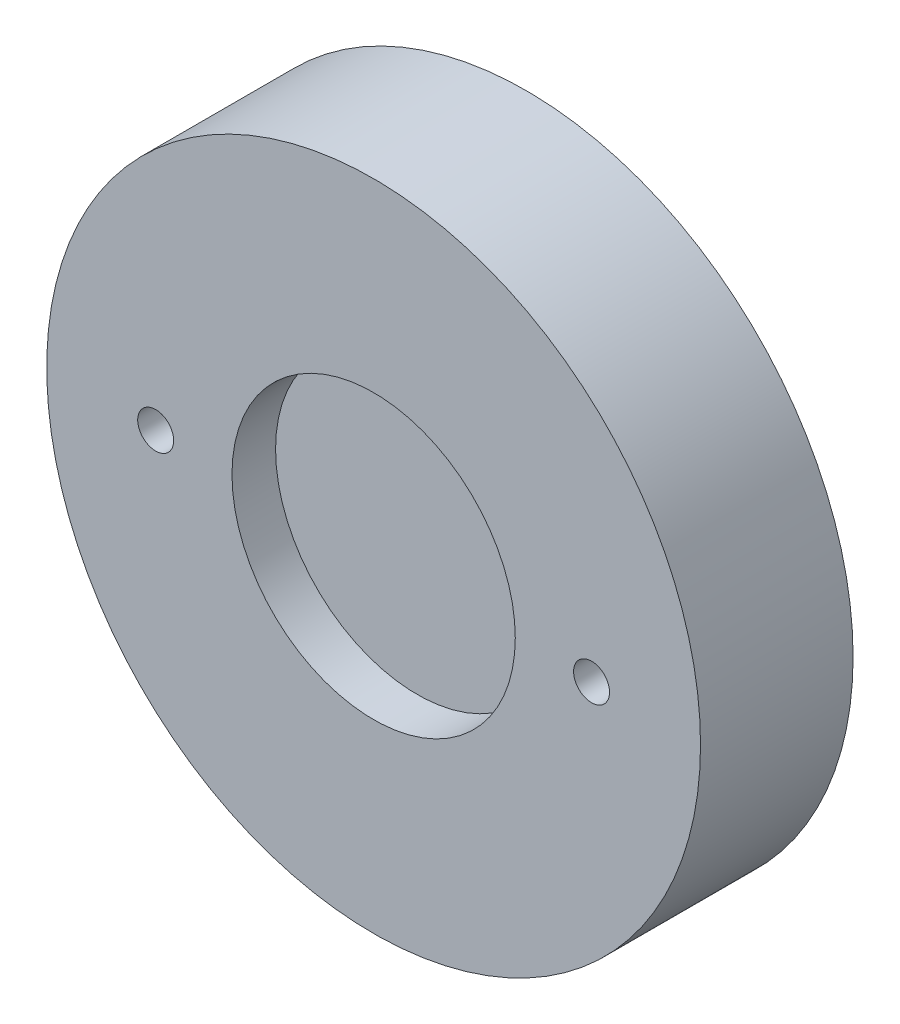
ISO-10303-21;
HEADER;
FILE_DESCRIPTION(('STEP AP214'),'2;1');
FILE_NAME('part.step','',(''),(''),'','','');
FILE_SCHEMA(('AUTOMOTIVE_DESIGN { 1 0 10303 214 1 1 1 1 }'));
ENDSEC;
DATA;
#1=APPLICATION_CONTEXT('core data for automotive mechanical design processes');
#2=APPLICATION_PROTOCOL_DEFINITION('international standard','automotive_design',2000,#1);
#3=PRODUCT_CONTEXT('',#1,'mechanical');
#4=PRODUCT('Part','Part','',(#3));
#5=PRODUCT_RELATED_PRODUCT_CATEGORY('part','',(#4));
#6=PRODUCT_DEFINITION_FORMATION('','',#4);
#7=PRODUCT_DEFINITION_CONTEXT('part definition',#1,'design');
#8=PRODUCT_DEFINITION('design','',#6,#7);
#9=PRODUCT_DEFINITION_SHAPE('','',#8);
#10=(LENGTH_UNIT() NAMED_UNIT(*) SI_UNIT(.MILLI.,.METRE.));
#11=(NAMED_UNIT(*) PLANE_ANGLE_UNIT() SI_UNIT($,.RADIAN.));
#12=(NAMED_UNIT(*) SI_UNIT($,.STERADIAN.) SOLID_ANGLE_UNIT());
#13=UNCERTAINTY_MEASURE_WITH_UNIT(LENGTH_MEASURE(1.E-05),#10,'distance_accuracy_value','');
#14=(GEOMETRIC_REPRESENTATION_CONTEXT(3) GLOBAL_UNCERTAINTY_ASSIGNED_CONTEXT((#13)) GLOBAL_UNIT_ASSIGNED_CONTEXT((#10,
#11,#12)) REPRESENTATION_CONTEXT('',''));
#15=CARTESIAN_POINT('',(0.,0.,0.));
#16=DIRECTION('',(0.,0.,1.));
#17=DIRECTION('',(1.,0.,0.));
#18=AXIS2_PLACEMENT_3D('',#15,#16,#17);
#19=CARTESIAN_POINT('',(0.,0.,28.));
#20=DIRECTION('',(0.,0.,-1.));
#21=DIRECTION('',(-1.,0.,0.));
#22=AXIS2_PLACEMENT_3D('',#19,#20,#21);
#23=CYLINDRICAL_SURFACE('',#22,60.);
#24=CARTESIAN_POINT('',(0.,0.,28.));
#25=DIRECTION('',(0.,0.,1.));
#26=DIRECTION('',(1.,0.,0.));
#27=AXIS2_PLACEMENT_3D('',#24,#25,#26);
#28=CIRCLE('',#27,60.);
#29=CARTESIAN_POINT('',(60.,0.,28.));
#30=VERTEX_POINT('',#29);
#31=EDGE_CURVE('E75',#30,#30,#28,.T.);
#32=ORIENTED_EDGE('',*,*,#31,.F.);
#33=EDGE_LOOP('',(#32));
#34=FACE_BOUND('',#33,.T.);
#35=CARTESIAN_POINT('',(0.,0.,0.));
#36=DIRECTION('',(0.,0.,1.));
#37=DIRECTION('',(1.,0.,0.));
#38=AXIS2_PLACEMENT_3D('',#35,#36,#37);
#39=CIRCLE('',#38,60.);
#40=CARTESIAN_POINT('',(60.,0.,0.));
#41=VERTEX_POINT('',#40);
#42=EDGE_CURVE('E72',#41,#41,#39,.T.);
#43=ORIENTED_EDGE('',*,*,#42,.T.);
#44=EDGE_LOOP('',(#43));
#45=FACE_BOUND('',#44,.T.);
#46=ADVANCED_FACE('F34',(#34,#45),#23,.T.);
#47=CARTESIAN_POINT('',(0.,0.,28.));
#48=DIRECTION('',(0.,0.,1.));
#49=DIRECTION('',(1.,0.,0.));
#50=AXIS2_PLACEMENT_3D('',#47,#48,#49);
#51=PLANE('',#50);
#52=CARTESIAN_POINT('',(-40.,0.,28.));
#53=DIRECTION('',(0.,0.,1.));
#54=DIRECTION('',(1.,0.,0.));
#55=AXIS2_PLACEMENT_3D('',#52,#53,#54);
#56=CIRCLE('',#55,3.29999999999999);
#57=CARTESIAN_POINT('',(-36.7,0.,28.));
#58=VERTEX_POINT('',#57);
#59=EDGE_CURVE('E54',#58,#58,#56,.T.);
#60=ORIENTED_EDGE('',*,*,#59,.F.);
#61=EDGE_LOOP('',(#60));
#62=FACE_BOUND('',#61,.T.);
#63=CARTESIAN_POINT('',(40.,0.,28.));
#64=DIRECTION('',(0.,0.,1.));
#65=DIRECTION('',(1.,0.,0.));
#66=AXIS2_PLACEMENT_3D('',#63,#64,#65);
#67=CIRCLE('',#66,3.29999999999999);
#68=CARTESIAN_POINT('',(43.3,0.,28.));
#69=VERTEX_POINT('',#68);
#70=EDGE_CURVE('E62',#69,#69,#67,.T.);
#71=ORIENTED_EDGE('',*,*,#70,.F.);
#72=EDGE_LOOP('',(#71));
#73=FACE_BOUND('',#72,.T.);
#74=CARTESIAN_POINT('',(0.,0.,28.));
#75=DIRECTION('',(0.,0.,1.));
#76=DIRECTION('',(1.,0.,0.));
#77=AXIS2_PLACEMENT_3D('',#74,#75,#76);
#78=CIRCLE('',#77,26.);
#79=CARTESIAN_POINT('',(26.,0.,28.));
#80=VERTEX_POINT('',#79);
#81=EDGE_CURVE('E68',#80,#80,#78,.T.);
#82=ORIENTED_EDGE('',*,*,#81,.F.);
#83=EDGE_LOOP('',(#82));
#84=FACE_BOUND('',#83,.T.);
#85=ORIENTED_EDGE('',*,*,#31,.T.);
#86=EDGE_LOOP('',(#85));
#87=FACE_BOUND('',#86,.T.);
#88=ADVANCED_FACE('F91',(#62,#73,#84,#87),#51,.T.);
#89=CARTESIAN_POINT('',(0.,0.,0.));
#90=DIRECTION('',(0.,0.,1.));
#91=DIRECTION('',(1.,0.,0.));
#92=AXIS2_PLACEMENT_3D('',#89,#90,#91);
#93=PLANE('',#92);
#94=CARTESIAN_POINT('',(-40.,0.,0.));
#95=DIRECTION('',(0.,0.,1.));
#96=DIRECTION('',(1.,0.,0.));
#97=AXIS2_PLACEMENT_3D('',#94,#95,#96);
#98=CIRCLE('',#97,3.29999999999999);
#99=CARTESIAN_POINT('',(-36.7,0.,0.));
#100=VERTEX_POINT('',#99);
#101=EDGE_CURVE('E57',#100,#100,#98,.T.);
#102=ORIENTED_EDGE('',*,*,#101,.T.);
#103=EDGE_LOOP('',(#102));
#104=FACE_BOUND('',#103,.T.);
#105=CARTESIAN_POINT('',(40.,0.,0.));
#106=DIRECTION('',(0.,0.,1.));
#107=DIRECTION('',(1.,0.,0.));
#108=AXIS2_PLACEMENT_3D('',#105,#106,#107);
#109=CIRCLE('',#108,3.29999999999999);
#110=CARTESIAN_POINT('',(43.3,0.,0.));
#111=VERTEX_POINT('',#110);
#112=EDGE_CURVE('E65',#111,#111,#109,.T.);
#113=ORIENTED_EDGE('',*,*,#112,.T.);
#114=EDGE_LOOP('',(#113));
#115=FACE_BOUND('',#114,.T.);
#116=ORIENTED_EDGE('',*,*,#42,.F.);
#117=EDGE_LOOP('',(#116));
#118=FACE_BOUND('',#117,.T.);
#119=ADVANCED_FACE('F96',(#104,#115,#118),#93,.F.);
#120=CARTESIAN_POINT('',(0.,0.,20.));
#121=DIRECTION('',(0.,0.,1.));
#122=DIRECTION('',(1.,0.,0.));
#123=AXIS2_PLACEMENT_3D('',#120,#121,#122);
#124=CYLINDRICAL_SURFACE('',#123,26.);
#125=CARTESIAN_POINT('',(0.,0.,20.));
#126=DIRECTION('',(0.,0.,1.));
#127=DIRECTION('',(1.,0.,0.));
#128=AXIS2_PLACEMENT_3D('',#125,#126,#127);
#129=CIRCLE('',#128,26.);
#130=CARTESIAN_POINT('',(26.,0.,20.));
#131=VERTEX_POINT('',#130);
#132=EDGE_CURVE('E69',#131,#131,#129,.T.);
#133=ORIENTED_EDGE('',*,*,#132,.F.);
#134=EDGE_LOOP('',(#133));
#135=FACE_BOUND('',#134,.T.);
#136=ORIENTED_EDGE('',*,*,#81,.T.);
#137=EDGE_LOOP('',(#136));
#138=FACE_BOUND('',#137,.T.);
#139=ADVANCED_FACE('F103',(#135,#138),#124,.F.);
#140=CARTESIAN_POINT('',(0.,0.,20.));
#141=DIRECTION('',(0.,0.,1.));
#142=DIRECTION('',(1.,0.,0.));
#143=AXIS2_PLACEMENT_3D('',#140,#141,#142);
#144=PLANE('',#143);
#145=CARTESIAN_POINT('',(19.5,0.,20.));
#146=DIRECTION('',(0.,0.,1.));
#147=DIRECTION('',(1.,0.,0.));
#148=AXIS2_PLACEMENT_3D('',#145,#146,#147);
#149=CIRCLE('',#148,2.50000000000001);
#150=CARTESIAN_POINT('',(22.,0.,20.));
#151=VERTEX_POINT('',#150);
#152=EDGE_CURVE('E11',#151,#151,#149,.F.);
#153=ORIENTED_EDGE('',*,*,#152,.T.);
#154=EDGE_LOOP('',(#153));
#155=FACE_BOUND('',#154,.T.);
#156=ORIENTED_EDGE('',*,*,#132,.T.);
#157=EDGE_LOOP('',(#156));
#158=FACE_BOUND('',#157,.T.);
#159=ADVANCED_FACE('F108',(#155,#158),#144,.T.);
#160=CARTESIAN_POINT('',(40.,0.,28.));
#161=DIRECTION('',(0.,0.,1.));
#162=DIRECTION('',(1.,0.,0.));
#163=AXIS2_PLACEMENT_3D('',#160,#161,#162);
#164=CYLINDRICAL_SURFACE('',#163,3.29999999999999);
#165=ORIENTED_EDGE('',*,*,#112,.F.);
#166=EDGE_LOOP('',(#165));
#167=FACE_BOUND('',#166,.T.);
#168=ORIENTED_EDGE('',*,*,#70,.T.);
#169=EDGE_LOOP('',(#168));
#170=FACE_BOUND('',#169,.T.);
#171=ADVANCED_FACE('F112',(#167,#170),#164,.F.);
#172=CARTESIAN_POINT('',(-40.,0.,28.));
#173=DIRECTION('',(0.,0.,1.));
#174=DIRECTION('',(1.,0.,0.));
#175=AXIS2_PLACEMENT_3D('',#172,#173,#174);
#176=CYLINDRICAL_SURFACE('',#175,3.29999999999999);
#177=ORIENTED_EDGE('',*,*,#101,.F.);
#178=EDGE_LOOP('',(#177));
#179=FACE_BOUND('',#178,.T.);
#180=ORIENTED_EDGE('',*,*,#59,.T.);
#181=EDGE_LOOP('',(#180));
#182=FACE_BOUND('',#181,.T.);
#183=ADVANCED_FACE('F48',(#179,#182),#176,.F.);
#184=CARTESIAN_POINT('',(19.5,0.,10.));
#185=DIRECTION('',(0.,0.,1.));
#186=DIRECTION('',(1.,0.,0.));
#187=AXIS2_PLACEMENT_3D('',#184,#185,#186);
#188=CONICAL_SURFACE('',#187,1.99999999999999,1.02974425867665);
#189=CARTESIAN_POINT('',(19.5,0.,8.79827876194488));
#190=VERTEX_POINT('',#189);
#191=VERTEX_LOOP('',#190);
#192=FACE_BOUND('',#191,.T.);
#193=CARTESIAN_POINT('',(19.5,0.,10.));
#194=DIRECTION('',(0.,0.,1.));
#195=DIRECTION('',(1.,0.,0.));
#196=AXIS2_PLACEMENT_3D('',#193,#194,#195);
#197=CIRCLE('',#196,1.99999999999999);
#198=CARTESIAN_POINT('',(21.5,0.,10.));
#199=VERTEX_POINT('',#198);
#200=EDGE_CURVE('E52',#199,#199,#197,.T.);
#201=ORIENTED_EDGE('',*,*,#200,.T.);
#202=EDGE_LOOP('',(#201));
#203=FACE_BOUND('',#202,.T.);
#204=ADVANCED_FACE('F44',(#192,#203),#188,.F.);
#205=CARTESIAN_POINT('',(19.5,0.,20.));
#206=DIRECTION('',(0.,0.,1.));
#207=DIRECTION('',(1.,0.,0.));
#208=AXIS2_PLACEMENT_3D('',#205,#206,#207);
#209=CYLINDRICAL_SURFACE('',#208,1.99999999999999);
#210=CARTESIAN_POINT('',(19.5,0.,19.5));
#211=DIRECTION('',(0.,0.,1.));
#212=DIRECTION('',(1.,0.,0.));
#213=AXIS2_PLACEMENT_3D('',#210,#211,#212);
#214=CIRCLE('',#213,1.99999999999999);
#215=CARTESIAN_POINT('',(21.5,0.,19.5));
#216=VERTEX_POINT('',#215);
#217=EDGE_CURVE('E41',#216,#216,#214,.T.);
#218=ORIENTED_EDGE('',*,*,#217,.T.);
#219=EDGE_LOOP('',(#218));
#220=FACE_BOUND('',#219,.T.);
#221=ORIENTED_EDGE('',*,*,#200,.F.);
#222=EDGE_LOOP('',(#221));
#223=FACE_BOUND('',#222,.T.);
#224=ADVANCED_FACE('F47',(#220,#223),#209,.F.);
#225=CARTESIAN_POINT('',(19.5,0.,19.5));
#226=DIRECTION('',(0.,0.,1.));
#227=DIRECTION('',(1.,0.,0.));
#228=AXIS2_PLACEMENT_3D('',#225,#226,#227);
#229=CONICAL_SURFACE('',#228,1.99999999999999,0.78539816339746);
#230=ORIENTED_EDGE('',*,*,#152,.F.);
#231=EDGE_LOOP('',(#230));
#232=FACE_BOUND('',#231,.T.);
#233=ORIENTED_EDGE('',*,*,#217,.F.);
#234=EDGE_LOOP('',(#233));
#235=FACE_BOUND('',#234,.T.);
#236=ADVANCED_FACE('F36',(#232,#235),#229,.F.);
#237=CLOSED_SHELL('',(#46,#88,#119,#139,#159,#171,#183,#204,#224,#236));
#238=MANIFOLD_SOLID_BREP('B2',#237);
#239=ADVANCED_BREP_SHAPE_REPRESENTATION('',(#18,#238),#14);
#240=SHAPE_DEFINITION_REPRESENTATION(#9,#239);
ENDSEC;
END-ISO-10303-21;
